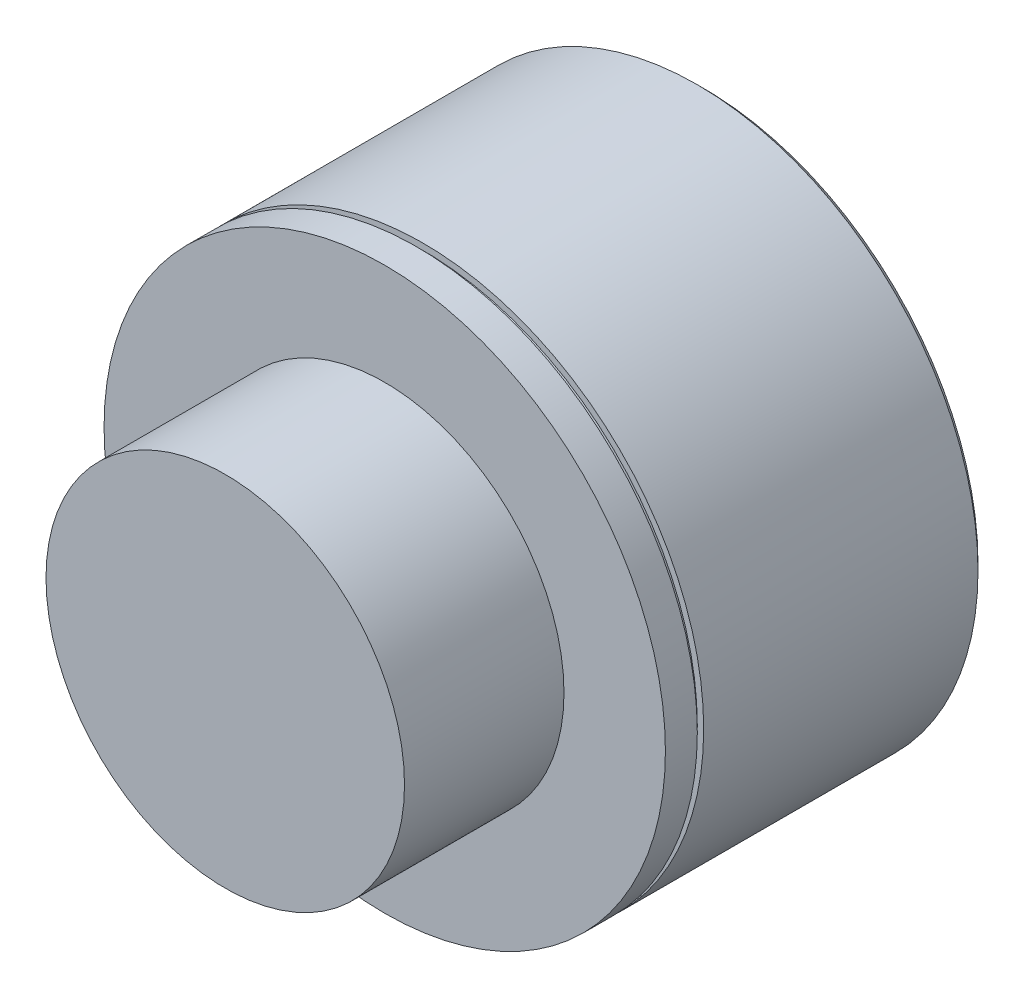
from build123d import *

# Parameters (mm, degrees)
SKETCH1_R           = 3.5687
BOSS_EXTRUDE1_DEPTH = 3.175
SKETCH2_R           = 5.588
BOSS_EXTRUDE2_DEPTH = 6.35
CHAMFER1_SIZE       = 0.127
SKETCH3_W           = 0.127
SKETCH3_H           = 0.127


with BuildPart() as part:
    # Sketch1 → Boss-Extrude1 (new body)
    with BuildSketch(Plane.XY):
        Circle(SKETCH1_R)
    extrude(amount=BOSS_EXTRUDE1_DEPTH)

    # Sketch2 → Boss-Extrude2 (add)
    with BuildSketch(Plane(origin=(0, 0, 0), x_dir=(-1, 0, 0), z_dir=(0, 0, -1))):
        Circle(SKETCH2_R)
    extrude(amount=BOSS_EXTRUDE2_DEPTH)

    # Chamfer1
    chamfer1_edges = [part.edges().sort_by_distance(p)[0] for p in [
        (5.588, 0, -6.35),
    ]]
    chamfer(chamfer1_edges, length=CHAMFER1_SIZE)

    # Sketch3 → Cut-Revolve1 (revolve, cut)
    with BuildSketch(Plane(origin=(0, 0, 0), x_dir=(0, 0, -1), z_dir=(1, 0, 0)), mode=Mode.PRIVATE) as cut_revolve1_sk:
        with Locations((0.6985, 5.5245)):
            Rectangle(SKETCH3_W, SKETCH3_H)
    revolve(cut_revolve1_sk.sketch.rotate(Axis((0, 0, 0), (0, 0, -1)), 90), axis=Axis((0, 0, 0), (0, 0, -1)), mode=Mode.SUBTRACT)


solid = part.part
